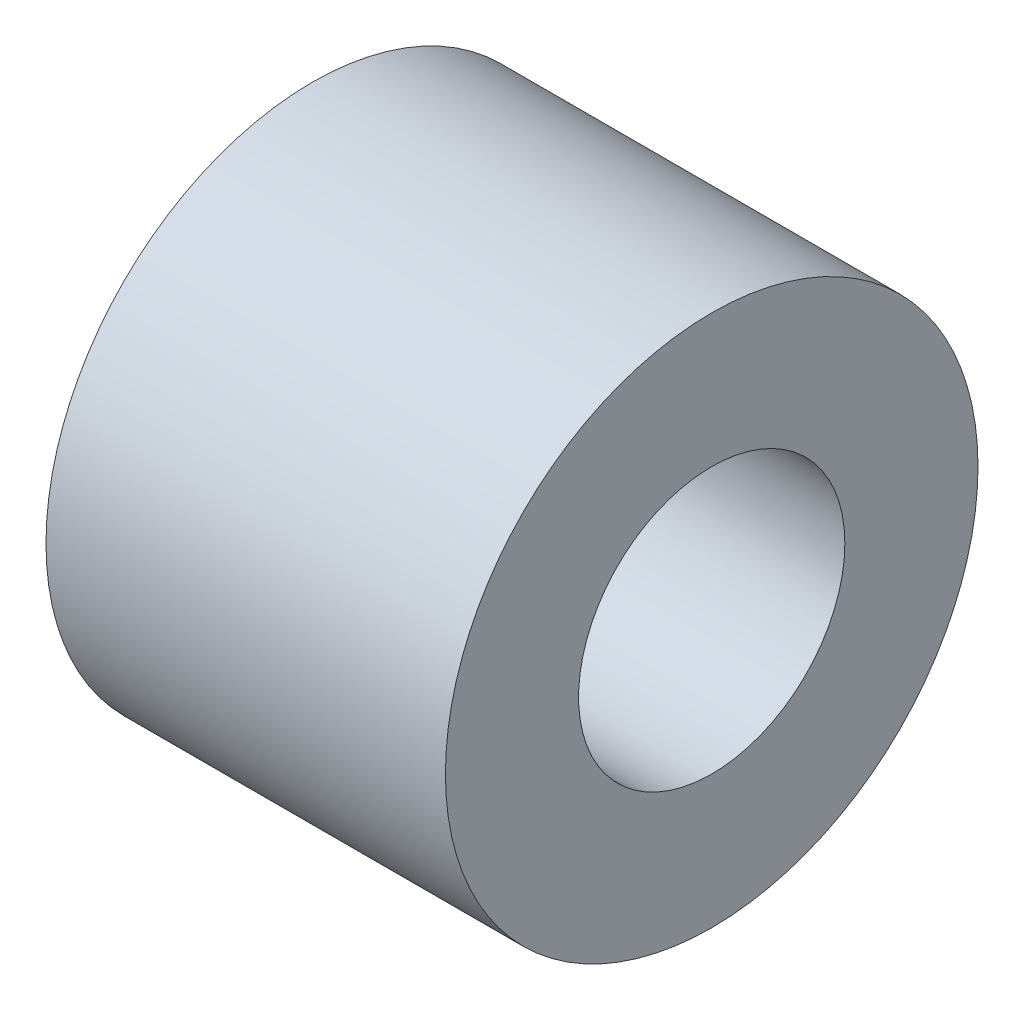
from build123d import *

# Parameters (mm, degrees)
ESQUISSE1_R        = 2
ESQUISSE1_R_2      = 1
BOSS_EXTRU_1_DEPTH = 3


with BuildPart() as part:
    # Esquisse1 → Boss.-Extru.1 (new body)
    with BuildSketch(Plane(origin=(0, 0, 0), x_dir=(0, 0, -1), z_dir=(1, 0, 0))):
        with Locations((0, -1.3417903)):
            Circle(ESQUISSE1_R)
        with Locations((0, -1.3417903)):
            Circle(ESQUISSE1_R_2, mode=Mode.SUBTRACT)
    extrude(amount=BOSS_EXTRU_1_DEPTH)


solid = part.part
